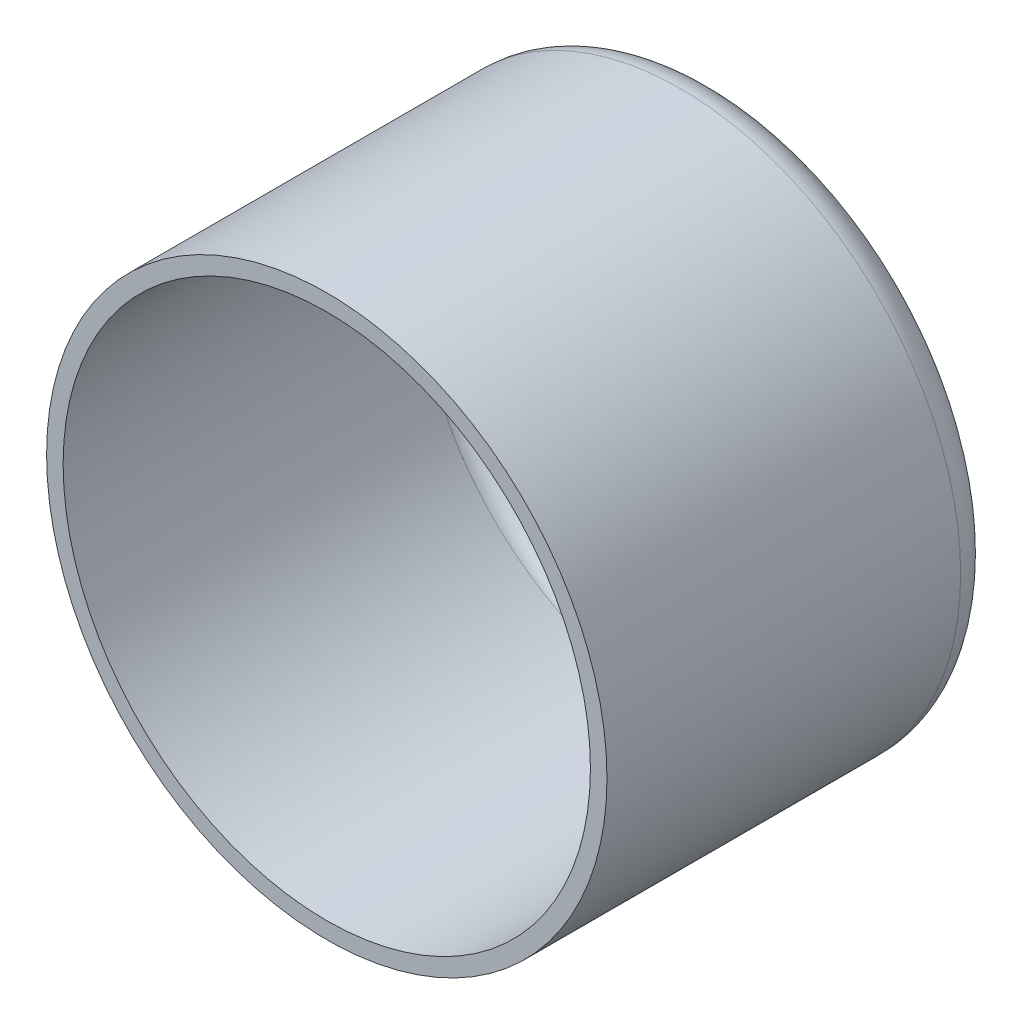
ISO-10303-21;
HEADER;
FILE_DESCRIPTION(('STEP AP214'),'2;1');
FILE_NAME('part.step','',(''),(''),'','','');
FILE_SCHEMA(('AUTOMOTIVE_DESIGN { 1 0 10303 214 1 1 1 1 }'));
ENDSEC;
DATA;
#1=APPLICATION_CONTEXT('core data for automotive mechanical design processes');
#2=APPLICATION_PROTOCOL_DEFINITION('international standard','automotive_design',2000,#1);
#3=PRODUCT_CONTEXT('',#1,'mechanical');
#4=PRODUCT('Part','Part','',(#3));
#5=PRODUCT_RELATED_PRODUCT_CATEGORY('part','',(#4));
#6=PRODUCT_DEFINITION_FORMATION('','',#4);
#7=PRODUCT_DEFINITION_CONTEXT('part definition',#1,'design');
#8=PRODUCT_DEFINITION('design','',#6,#7);
#9=PRODUCT_DEFINITION_SHAPE('','',#8);
#10=(LENGTH_UNIT() NAMED_UNIT(*) SI_UNIT(.MILLI.,.METRE.));
#11=(NAMED_UNIT(*) PLANE_ANGLE_UNIT() SI_UNIT($,.RADIAN.));
#12=(NAMED_UNIT(*) SI_UNIT($,.STERADIAN.) SOLID_ANGLE_UNIT());
#13=UNCERTAINTY_MEASURE_WITH_UNIT(LENGTH_MEASURE(1.E-05),#10,'distance_accuracy_value','');
#14=(GEOMETRIC_REPRESENTATION_CONTEXT(3) GLOBAL_UNCERTAINTY_ASSIGNED_CONTEXT((#13)) GLOBAL_UNIT_ASSIGNED_CONTEXT((#10,
#11,#12)) REPRESENTATION_CONTEXT('',''));
#15=CARTESIAN_POINT('',(0.,0.,0.));
#16=DIRECTION('',(0.,0.,1.));
#17=DIRECTION('',(1.,0.,0.));
#18=AXIS2_PLACEMENT_3D('',#15,#16,#17);
#19=CARTESIAN_POINT('',(0.,19.1389,-15.24));
#20=DIRECTION('',(0.,0.,1.));
#21=DIRECTION('',(1.,0.,0.));
#22=AXIS2_PLACEMENT_3D('',#19,#20,#21);
#23=PLANE('',#22);
#24=CARTESIAN_POINT('',(0.,0.,-15.24));
#25=DIRECTION('',(0.,0.,1.));
#26=DIRECTION('',(1.,0.,0.));
#27=AXIS2_PLACEMENT_3D('',#24,#25,#26);
#28=CIRCLE('',#27,19.1389);
#29=CARTESIAN_POINT('',(19.1389,0.,-15.24));
#30=VERTEX_POINT('',#29);
#31=EDGE_CURVE('E52',#30,#30,#28,.T.);
#32=ORIENTED_EDGE('',*,*,#31,.F.);
#33=EDGE_LOOP('',(#32));
#34=FACE_BOUND('',#33,.T.);
#35=ADVANCED_FACE('F30',(#34),#23,.F.);
#36=CARTESIAN_POINT('',(0.,19.1389,-13.9446));
#37=DIRECTION('',(0.,0.,-1.));
#38=DIRECTION('',(-1.,0.,0.));
#39=AXIS2_PLACEMENT_3D('',#36,#37,#38);
#40=PLANE('',#39);
#41=CARTESIAN_POINT('',(0.,0.,-13.9446));
#42=DIRECTION('',(0.,0.,1.));
#43=DIRECTION('',(1.,0.,0.));
#44=AXIS2_PLACEMENT_3D('',#41,#42,#43);
#45=CIRCLE('',#44,19.1389);
#46=CARTESIAN_POINT('',(19.1389,0.,-13.9446));
#47=VERTEX_POINT('',#46);
#48=EDGE_CURVE('E10',#47,#47,#45,.T.);
#49=ORIENTED_EDGE('',*,*,#48,.T.);
#50=EDGE_LOOP('',(#49));
#51=FACE_BOUND('',#50,.T.);
#52=ADVANCED_FACE('F59',(#51),#40,.F.);
#53=CARTESIAN_POINT('',(0.,0.,-12.446));
#54=DIRECTION('',(0.,0.,1.));
#55=DIRECTION('',(1.,0.,0.));
#56=AXIS2_PLACEMENT_3D('',#53,#54,#55);
#57=TOROIDAL_SURFACE('',#56,19.1389,1.49860000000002);
#58=ORIENTED_EDGE('',*,*,#48,.F.);
#59=EDGE_LOOP('',(#58));
#60=FACE_BOUND('',#59,.T.);
#61=CARTESIAN_POINT('',(0.,0.,-12.446));
#62=DIRECTION('',(0.,0.,1.));
#63=DIRECTION('',(1.,0.,0.));
#64=AXIS2_PLACEMENT_3D('',#61,#62,#63);
#65=CIRCLE('',#64,20.6375);
#66=CARTESIAN_POINT('',(20.6375,0.,-12.446));
#67=VERTEX_POINT('',#66);
#68=EDGE_CURVE('E36',#67,#67,#65,.T.);
#69=ORIENTED_EDGE('',*,*,#68,.T.);
#70=EDGE_LOOP('',(#69));
#71=FACE_BOUND('',#70,.T.);
#72=ADVANCED_FACE('F63',(#60,#71),#57,.F.);
#73=CARTESIAN_POINT('',(0.,0.,15.24));
#74=DIRECTION('',(0.,0.,1.));
#75=DIRECTION('',(1.,0.,0.));
#76=AXIS2_PLACEMENT_3D('',#73,#74,#75);
#77=CYLINDRICAL_SURFACE('',#76,20.6375);
#78=ORIENTED_EDGE('',*,*,#68,.F.);
#79=EDGE_LOOP('',(#78));
#80=FACE_BOUND('',#79,.T.);
#81=CARTESIAN_POINT('',(0.,0.,15.24));
#82=DIRECTION('',(0.,0.,1.));
#83=DIRECTION('',(1.,0.,0.));
#84=AXIS2_PLACEMENT_3D('',#81,#82,#83);
#85=CIRCLE('',#84,20.6375);
#86=CARTESIAN_POINT('',(20.6375,0.,15.24));
#87=VERTEX_POINT('',#86);
#88=EDGE_CURVE('E40',#87,#87,#85,.T.);
#89=ORIENTED_EDGE('',*,*,#88,.T.);
#90=EDGE_LOOP('',(#89));
#91=FACE_BOUND('',#90,.T.);
#92=ADVANCED_FACE('F67',(#80,#91),#77,.F.);
#93=CARTESIAN_POINT('',(0.,21.9329,15.24));
#94=DIRECTION('',(0.,0.,-1.));
#95=DIRECTION('',(-1.,0.,0.));
#96=AXIS2_PLACEMENT_3D('',#93,#94,#95);
#97=PLANE('',#96);
#98=ORIENTED_EDGE('',*,*,#88,.F.);
#99=EDGE_LOOP('',(#98));
#100=FACE_BOUND('',#99,.T.);
#101=CARTESIAN_POINT('',(0.,0.,15.24));
#102=DIRECTION('',(0.,0.,1.));
#103=DIRECTION('',(1.,0.,0.));
#104=AXIS2_PLACEMENT_3D('',#101,#102,#103);
#105=CIRCLE('',#104,21.9329);
#106=CARTESIAN_POINT('',(21.9329,0.,15.24));
#107=VERTEX_POINT('',#106);
#108=EDGE_CURVE('E44',#107,#107,#105,.T.);
#109=ORIENTED_EDGE('',*,*,#108,.T.);
#110=EDGE_LOOP('',(#109));
#111=FACE_BOUND('',#110,.T.);
#112=ADVANCED_FACE('F73',(#100,#111),#97,.F.);
#113=CARTESIAN_POINT('',(0.,0.,15.24));
#114=DIRECTION('',(0.,0.,1.));
#115=DIRECTION('',(1.,0.,0.));
#116=AXIS2_PLACEMENT_3D('',#113,#114,#115);
#117=CYLINDRICAL_SURFACE('',#116,21.9329);
#118=ORIENTED_EDGE('',*,*,#108,.F.);
#119=EDGE_LOOP('',(#118));
#120=FACE_BOUND('',#119,.T.);
#121=CARTESIAN_POINT('',(0.,0.,-12.446));
#122=DIRECTION('',(0.,0.,1.));
#123=DIRECTION('',(1.,0.,0.));
#124=AXIS2_PLACEMENT_3D('',#121,#122,#123);
#125=CIRCLE('',#124,21.9329);
#126=CARTESIAN_POINT('',(21.9329,0.,-12.446));
#127=VERTEX_POINT('',#126);
#128=EDGE_CURVE('E49',#127,#127,#125,.T.);
#129=ORIENTED_EDGE('',*,*,#128,.T.);
#130=EDGE_LOOP('',(#129));
#131=FACE_BOUND('',#130,.T.);
#132=ADVANCED_FACE('F77',(#120,#131),#117,.T.);
#133=CARTESIAN_POINT('',(0.,0.,-12.446));
#134=DIRECTION('',(0.,0.,1.));
#135=DIRECTION('',(1.,0.,0.));
#136=AXIS2_PLACEMENT_3D('',#133,#134,#135);
#137=TOROIDAL_SURFACE('',#136,19.1389,2.794);
#138=ORIENTED_EDGE('',*,*,#128,.F.);
#139=EDGE_LOOP('',(#138));
#140=FACE_BOUND('',#139,.T.);
#141=ORIENTED_EDGE('',*,*,#31,.T.);
#142=EDGE_LOOP('',(#141));
#143=FACE_BOUND('',#142,.T.);
#144=ADVANCED_FACE('F56',(#140,#143),#137,.T.);
#145=CLOSED_SHELL('',(#35,#52,#72,#92,#112,#132,#144));
#146=MANIFOLD_SOLID_BREP('B2',#145);
#147=ADVANCED_BREP_SHAPE_REPRESENTATION('',(#18,#146),#14);
#148=SHAPE_DEFINITION_REPRESENTATION(#9,#147);
ENDSEC;
END-ISO-10303-21;
